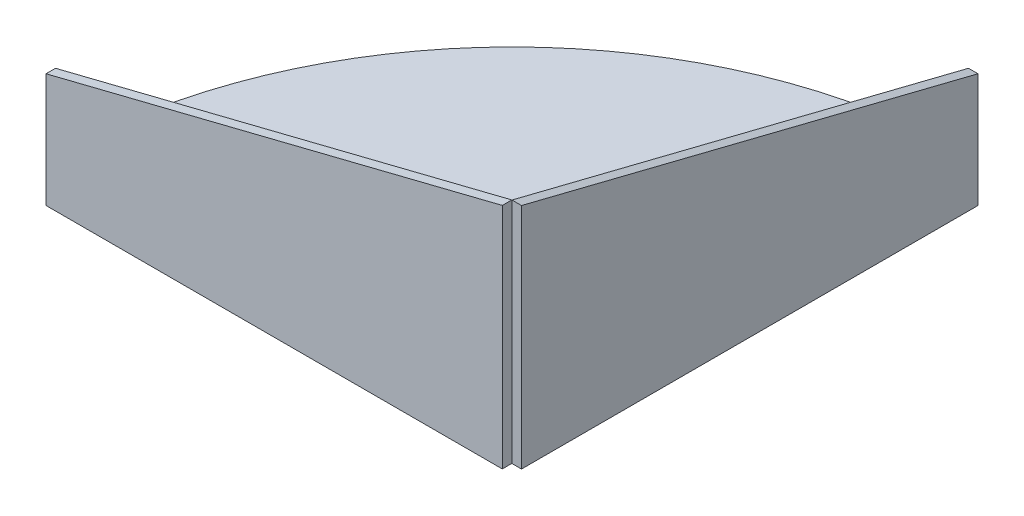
ISO-10303-21;
HEADER;
FILE_DESCRIPTION(('STEP AP214'),'2;1');
FILE_NAME('part.step','',(''),(''),'','','');
FILE_SCHEMA(('AUTOMOTIVE_DESIGN { 1 0 10303 214 1 1 1 1 }'));
ENDSEC;
DATA;
#1=APPLICATION_CONTEXT('core data for automotive mechanical design processes');
#2=APPLICATION_PROTOCOL_DEFINITION('international standard','automotive_design',2000,#1);
#3=PRODUCT_CONTEXT('',#1,'mechanical');
#4=PRODUCT('Part','Part','',(#3));
#5=PRODUCT_RELATED_PRODUCT_CATEGORY('part','',(#4));
#6=PRODUCT_DEFINITION_FORMATION('','',#4);
#7=PRODUCT_DEFINITION_CONTEXT('part definition',#1,'design');
#8=PRODUCT_DEFINITION('design','',#6,#7);
#9=PRODUCT_DEFINITION_SHAPE('','',#8);
#10=(LENGTH_UNIT() NAMED_UNIT(*) SI_UNIT(.MILLI.,.METRE.));
#11=(NAMED_UNIT(*) PLANE_ANGLE_UNIT() SI_UNIT($,.RADIAN.));
#12=(NAMED_UNIT(*) SI_UNIT($,.STERADIAN.) SOLID_ANGLE_UNIT());
#13=UNCERTAINTY_MEASURE_WITH_UNIT(LENGTH_MEASURE(1.E-05),#10,'distance_accuracy_value','');
#14=(GEOMETRIC_REPRESENTATION_CONTEXT(3) GLOBAL_UNCERTAINTY_ASSIGNED_CONTEXT((#13)) GLOBAL_UNIT_ASSIGNED_CONTEXT((#10,
#11,#12)) REPRESENTATION_CONTEXT('',''));
#15=CARTESIAN_POINT('',(0.,0.,0.));
#16=DIRECTION('',(0.,0.,1.));
#17=DIRECTION('',(1.,0.,0.));
#18=AXIS2_PLACEMENT_3D('',#15,#16,#17);
#19=CARTESIAN_POINT('',(-304.8,12.7,304.8));
#20=DIRECTION('',(0.,0.,-1.));
#21=DIRECTION('',(-1.,0.,0.));
#22=AXIS2_PLACEMENT_3D('',#19,#20,#21);
#23=PLANE('',#22);
#24=DIRECTION('',(0.,1.,0.));
#25=VECTOR('',#24,1.);
#26=CARTESIAN_POINT('',(304.546,266.7,304.8));
#27=LINE('',#26,#25);
#28=CARTESIAN_POINT('',(304.546,0.,304.8));
#29=VERTEX_POINT('',#28);
#30=CARTESIAN_POINT('',(304.546,12.7000000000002,304.8));
#31=VERTEX_POINT('',#30);
#32=EDGE_CURVE('E11',#29,#31,#27,.T.);
#33=ORIENTED_EDGE('',*,*,#32,.F.);
#34=DIRECTION('',(1.,0.,0.));
#35=VECTOR('',#34,1.);
#36=CARTESIAN_POINT('',(-304.8,0.,304.8));
#37=LINE('',#36,#35);
#38=CARTESIAN_POINT('',(304.8,0.,304.8));
#39=VERTEX_POINT('',#38);
#40=EDGE_CURVE('E197',#29,#39,#37,.T.);
#41=ORIENTED_EDGE('',*,*,#40,.T.);
#42=DIRECTION('',(0.,-1.,0.));
#43=VECTOR('',#42,1.);
#44=CARTESIAN_POINT('',(304.8,12.7,304.8));
#45=LINE('',#44,#43);
#46=CARTESIAN_POINT('',(304.8,-38.1,304.8));
#47=VERTEX_POINT('',#46);
#48=EDGE_CURVE('E237',#39,#47,#45,.T.);
#49=ORIENTED_EDGE('',*,*,#48,.T.);
#50=DIRECTION('',(-1.,0.,0.));
#51=VECTOR('',#50,1.);
#52=CARTESIAN_POINT('',(317.5,-38.1,304.8));
#53=LINE('',#52,#51);
#54=CARTESIAN_POINT('',(317.5,-38.1,304.8));
#55=VERTEX_POINT('',#54);
#56=EDGE_CURVE('E248',#55,#47,#53,.T.);
#57=ORIENTED_EDGE('',*,*,#56,.F.);
#58=DIRECTION('',(0.,-1.,0.));
#59=VECTOR('',#58,1.);
#60=CARTESIAN_POINT('',(317.5,12.7,304.8));
#61=LINE('',#60,#59);
#62=CARTESIAN_POINT('',(317.5,266.7,304.8));
#63=VERTEX_POINT('',#62);
#64=EDGE_CURVE('E247',#63,#55,#61,.T.);
#65=ORIENTED_EDGE('',*,*,#64,.F.);
#66=DIRECTION('',(-1.,0.,0.));
#67=VECTOR('',#66,1.);
#68=CARTESIAN_POINT('',(317.5,266.7,304.8));
#69=LINE('',#68,#67);
#70=CARTESIAN_POINT('',(304.8,266.7,304.8));
#71=VERTEX_POINT('',#70);
#72=EDGE_CURVE('E240',#63,#71,#69,.T.);
#73=ORIENTED_EDGE('',*,*,#72,.T.);
#74=CARTESIAN_POINT('',(304.8,12.7,304.8));
#75=VERTEX_POINT('',#74);
#76=EDGE_CURVE('E244',#71,#75,#45,.T.);
#77=ORIENTED_EDGE('',*,*,#76,.T.);
#78=DIRECTION('',(1.,0.,0.));
#79=VECTOR('',#78,1.);
#80=CARTESIAN_POINT('',(-304.8,12.7,304.8));
#81=LINE('',#80,#79);
#82=EDGE_CURVE('E213',#31,#75,#81,.T.);
#83=ORIENTED_EDGE('',*,*,#82,.F.);
#84=EDGE_LOOP('',(#33,#41,#49,#57,#65,#73,#77,#83));
#85=FACE_BOUND('',#84,.T.);
#86=ADVANCED_FACE('F31',(#85),#23,.F.);
#87=CARTESIAN_POINT('',(304.8,12.7,304.8));
#88=DIRECTION('',(0.,-1.,0.));
#89=DIRECTION('',(0.,0.,-1.));
#90=AXIS2_PLACEMENT_3D('',#87,#88,#89);
#91=CYLINDRICAL_SURFACE('',#90,609.6);
#92=CARTESIAN_POINT('',(304.8,0.,304.8));
#93=DIRECTION('',(0.,1.,0.));
#94=DIRECTION('',(0.,0.,-1.));
#95=AXIS2_PLACEMENT_3D('',#92,#93,#94);
#96=CIRCLE('',#95,609.6);
#97=CARTESIAN_POINT('',(304.8,0.,-304.8));
#98=VERTEX_POINT('',#97);
#99=CARTESIAN_POINT('',(-304.8,0.,304.8));
#100=VERTEX_POINT('',#99);
#101=EDGE_CURVE('E68',#98,#100,#96,.T.);
#102=ORIENTED_EDGE('',*,*,#101,.T.);
#103=DIRECTION('',(0.,-1.,0.));
#104=VECTOR('',#103,1.);
#105=CARTESIAN_POINT('',(-304.8,12.7,304.8));
#106=LINE('',#105,#104);
#107=CARTESIAN_POINT('',(-304.8,12.7,304.8));
#108=VERTEX_POINT('',#107);
#109=EDGE_CURVE('E215',#108,#100,#106,.T.);
#110=ORIENTED_EDGE('',*,*,#109,.F.);
#111=CARTESIAN_POINT('',(304.8,12.7,304.8));
#112=DIRECTION('',(0.,1.,0.));
#113=DIRECTION('',(0.,0.,-1.));
#114=AXIS2_PLACEMENT_3D('',#111,#112,#113);
#115=CIRCLE('',#114,609.6);
#116=CARTESIAN_POINT('',(304.8,12.7,-304.8));
#117=VERTEX_POINT('',#116);
#118=EDGE_CURVE('E57',#117,#108,#115,.T.);
#119=ORIENTED_EDGE('',*,*,#118,.F.);
#120=DIRECTION('',(0.,-1.,0.));
#121=VECTOR('',#120,1.);
#122=CARTESIAN_POINT('',(304.8,12.7,-304.8));
#123=LINE('',#122,#121);
#124=EDGE_CURVE('E40',#117,#98,#123,.T.);
#125=ORIENTED_EDGE('',*,*,#124,.T.);
#126=EDGE_LOOP('',(#102,#110,#119,#125));
#127=FACE_BOUND('',#126,.T.);
#128=ADVANCED_FACE('F33',(#127),#91,.T.);
#129=CARTESIAN_POINT('',(304.8,12.7,304.8));
#130=DIRECTION('',(0.,-1.,0.));
#131=DIRECTION('',(0.,0.,-1.));
#132=AXIS2_PLACEMENT_3D('',#129,#130,#131);
#133=PLANE('',#132);
#134=DIRECTION('',(0.,0.,-1.));
#135=VECTOR('',#134,1.);
#136=CARTESIAN_POINT('',(304.8,12.7,-304.8));
#137=LINE('',#136,#135);
#138=EDGE_CURVE('E196',#75,#117,#137,.T.);
#139=ORIENTED_EDGE('',*,*,#138,.T.);
#140=ORIENTED_EDGE('',*,*,#118,.T.);
#141=EDGE_CURVE('E214',#108,#31,#81,.T.);
#142=ORIENTED_EDGE('',*,*,#141,.T.);
#143=ORIENTED_EDGE('',*,*,#82,.T.);
#144=EDGE_LOOP('',(#139,#140,#142,#143));
#145=FACE_BOUND('',#144,.T.);
#146=ADVANCED_FACE('F301',(#145),#133,.F.);
#147=CARTESIAN_POINT('',(304.8,0.,304.8));
#148=DIRECTION('',(0.,-1.,0.));
#149=DIRECTION('',(0.,0.,-1.));
#150=AXIS2_PLACEMENT_3D('',#147,#148,#149);
#151=PLANE('',#150);
#152=DIRECTION('',(0.,0.,-1.));
#153=VECTOR('',#152,1.);
#154=CARTESIAN_POINT('',(304.8,0.,-304.8));
#155=LINE('',#154,#153);
#156=EDGE_CURVE('E76',#39,#98,#155,.T.);
#157=ORIENTED_EDGE('',*,*,#156,.F.);
#158=ORIENTED_EDGE('',*,*,#40,.F.);
#159=EDGE_CURVE('E193',#100,#29,#37,.T.);
#160=ORIENTED_EDGE('',*,*,#159,.F.);
#161=ORIENTED_EDGE('',*,*,#101,.F.);
#162=EDGE_LOOP('',(#157,#158,#160,#161));
#163=FACE_BOUND('',#162,.T.);
#164=ADVANCED_FACE('F303',(#163),#151,.T.);
#165=CARTESIAN_POINT('',(304.8,-38.1,304.8));
#166=DIRECTION('',(1.,0.,0.));
#167=DIRECTION('',(0.,0.,-1.));
#168=AXIS2_PLACEMENT_3D('',#165,#166,#167);
#169=PLANE('',#168);
#170=ORIENTED_EDGE('',*,*,#48,.F.);
#171=ORIENTED_EDGE('',*,*,#156,.T.);
#172=DIRECTION('',(0.,1.,0.));
#173=VECTOR('',#172,1.);
#174=CARTESIAN_POINT('',(304.8,114.3,-304.8));
#175=LINE('',#174,#173);
#176=CARTESIAN_POINT('',(304.8,-38.1,-304.8));
#177=VERTEX_POINT('',#176);
#178=EDGE_CURVE('E229',#177,#98,#175,.T.);
#179=ORIENTED_EDGE('',*,*,#178,.F.);
#180=DIRECTION('',(0.,0.,-1.));
#181=VECTOR('',#180,1.);
#182=CARTESIAN_POINT('',(304.8,-38.1,304.8));
#183=LINE('',#182,#181);
#184=EDGE_CURVE('E159',#47,#177,#183,.T.);
#185=ORIENTED_EDGE('',*,*,#184,.F.);
#186=EDGE_LOOP('',(#170,#171,#179,#185));
#187=FACE_BOUND('',#186,.T.);
#188=ADVANCED_FACE('F306',(#187),#169,.F.);
#189=CARTESIAN_POINT('',(317.5,-38.1,304.8));
#190=DIRECTION('',(0.,1.,0.));
#191=DIRECTION('',(0.,0.,1.));
#192=AXIS2_PLACEMENT_3D('',#189,#190,#191);
#193=PLANE('',#192);
#194=ORIENTED_EDGE('',*,*,#184,.T.);
#195=DIRECTION('',(-1.,0.,0.));
#196=VECTOR('',#195,1.);
#197=CARTESIAN_POINT('',(317.5,-38.1,-304.8));
#198=LINE('',#197,#196);
#199=CARTESIAN_POINT('',(317.5,-38.1,-304.8));
#200=VERTEX_POINT('',#199);
#201=EDGE_CURVE('E251',#200,#177,#198,.T.);
#202=ORIENTED_EDGE('',*,*,#201,.F.);
#203=DIRECTION('',(0.,0.,-1.));
#204=VECTOR('',#203,1.);
#205=CARTESIAN_POINT('',(317.5,-38.1,304.8));
#206=LINE('',#205,#204);
#207=EDGE_CURVE('E267',#55,#200,#206,.T.);
#208=ORIENTED_EDGE('',*,*,#207,.F.);
#209=ORIENTED_EDGE('',*,*,#56,.T.);
#210=EDGE_LOOP('',(#194,#202,#208,#209));
#211=FACE_BOUND('',#210,.T.);
#212=ADVANCED_FACE('F275',(#211),#193,.F.);
#213=CARTESIAN_POINT('',(317.5,114.3,-304.8));
#214=DIRECTION('',(0.,0.,1.));
#215=DIRECTION('',(1.,0.,0.));
#216=AXIS2_PLACEMENT_3D('',#213,#214,#215);
#217=PLANE('',#216);
#218=ORIENTED_EDGE('',*,*,#178,.T.);
#219=ORIENTED_EDGE('',*,*,#124,.F.);
#220=CARTESIAN_POINT('',(304.8,114.3,-304.8));
#221=VERTEX_POINT('',#220);
#222=EDGE_CURVE('E162',#117,#221,#175,.T.);
#223=ORIENTED_EDGE('',*,*,#222,.T.);
#224=DIRECTION('',(-1.,0.,0.));
#225=VECTOR('',#224,1.);
#226=CARTESIAN_POINT('',(317.5,114.3,-304.8));
#227=LINE('',#226,#225);
#228=CARTESIAN_POINT('',(317.5,114.3,-304.8));
#229=VERTEX_POINT('',#228);
#230=EDGE_CURVE('E253',#229,#221,#227,.T.);
#231=ORIENTED_EDGE('',*,*,#230,.F.);
#232=DIRECTION('',(0.,1.,0.));
#233=VECTOR('',#232,1.);
#234=CARTESIAN_POINT('',(317.5,-38.1,-304.8));
#235=LINE('',#234,#233);
#236=EDGE_CURVE('E264',#200,#229,#235,.T.);
#237=ORIENTED_EDGE('',*,*,#236,.F.);
#238=ORIENTED_EDGE('',*,*,#201,.T.);
#239=EDGE_LOOP('',(#218,#219,#223,#231,#237,#238));
#240=FACE_BOUND('',#239,.T.);
#241=ADVANCED_FACE('F278',(#240),#217,.F.);
#242=CARTESIAN_POINT('',(317.5,266.7,304.8));
#243=DIRECTION('',(0.,-0.970142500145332,0.242535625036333));
#244=DIRECTION('',(0.,-0.242535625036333,-0.970142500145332));
#245=AXIS2_PLACEMENT_3D('',#242,#243,#244);
#246=PLANE('',#245);
#247=DIRECTION('',(0.,0.242535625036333,0.970142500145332));
#248=VECTOR('',#247,1.);
#249=CARTESIAN_POINT('',(304.8,266.7,304.8));
#250=LINE('',#249,#248);
#251=EDGE_CURVE('E234',#221,#71,#250,.T.);
#252=ORIENTED_EDGE('',*,*,#251,.T.);
#253=ORIENTED_EDGE('',*,*,#72,.F.);
#254=DIRECTION('',(0.,0.242535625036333,0.970142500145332));
#255=VECTOR('',#254,1.);
#256=CARTESIAN_POINT('',(317.5,266.7,304.8));
#257=LINE('',#256,#255);
#258=EDGE_CURVE('E260',#229,#63,#257,.T.);
#259=ORIENTED_EDGE('',*,*,#258,.F.);
#260=ORIENTED_EDGE('',*,*,#230,.T.);
#261=EDGE_LOOP('',(#252,#253,#259,#260));
#262=FACE_BOUND('',#261,.T.);
#263=ADVANCED_FACE('F280',(#262),#246,.F.);
#264=CARTESIAN_POINT('',(317.5,-38.1,304.8));
#265=DIRECTION('',(1.,0.,0.));
#266=DIRECTION('',(0.,0.,-1.));
#267=AXIS2_PLACEMENT_3D('',#264,#265,#266);
#268=PLANE('',#267);
#269=ORIENTED_EDGE('',*,*,#64,.T.);
#270=ORIENTED_EDGE('',*,*,#207,.T.);
#271=ORIENTED_EDGE('',*,*,#236,.T.);
#272=ORIENTED_EDGE('',*,*,#258,.T.);
#273=EDGE_LOOP('',(#269,#270,#271,#272));
#274=FACE_BOUND('',#273,.T.);
#275=ADVANCED_FACE('F271',(#274),#268,.T.);
#276=ORIENTED_EDGE('',*,*,#138,.F.);
#277=ORIENTED_EDGE('',*,*,#76,.F.);
#278=ORIENTED_EDGE('',*,*,#251,.F.);
#279=ORIENTED_EDGE('',*,*,#222,.F.);
#280=EDGE_LOOP('',(#276,#277,#278,#279));
#281=FACE_BOUND('',#280,.T.);
#282=ADVANCED_FACE('F283',(#281),#169,.F.);
#283=CARTESIAN_POINT('',(-304.8,114.3,304.8));
#284=DIRECTION('',(0.,0.,1.));
#285=DIRECTION('',(1.,0.,0.));
#286=AXIS2_PLACEMENT_3D('',#283,#284,#285);
#287=PLANE('',#286);
#288=DIRECTION('',(0.,-1.,0.));
#289=VECTOR('',#288,1.);
#290=CARTESIAN_POINT('',(-304.8,114.3,304.8));
#291=LINE('',#290,#289);
#292=CARTESIAN_POINT('',(-304.8,-38.1,304.8));
#293=VERTEX_POINT('',#292);
#294=EDGE_CURVE('E172',#100,#293,#291,.T.);
#295=ORIENTED_EDGE('',*,*,#294,.F.);
#296=ORIENTED_EDGE('',*,*,#159,.T.);
#297=CARTESIAN_POINT('',(304.546,-38.1,304.8));
#298=VERTEX_POINT('',#297);
#299=EDGE_CURVE('E42',#298,#29,#27,.T.);
#300=ORIENTED_EDGE('',*,*,#299,.F.);
#301=DIRECTION('',(1.,0.,0.));
#302=VECTOR('',#301,1.);
#303=CARTESIAN_POINT('',(-304.8,-38.1,304.8));
#304=LINE('',#303,#302);
#305=EDGE_CURVE('E171',#293,#298,#304,.T.);
#306=ORIENTED_EDGE('',*,*,#305,.F.);
#307=EDGE_LOOP('',(#295,#296,#300,#306));
#308=FACE_BOUND('',#307,.T.);
#309=ADVANCED_FACE('F192',(#308),#287,.F.);
#310=CARTESIAN_POINT('',(304.546,266.7,317.5));
#311=DIRECTION('',(0.242630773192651,-0.970118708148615,0.));
#312=DIRECTION('',(0.970118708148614,0.242630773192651,0.));
#313=AXIS2_PLACEMENT_3D('',#310,#311,#312);
#314=PLANE('',#313);
#315=DIRECTION('',(-0.970118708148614,-0.24263077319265,0.));
#316=VECTOR('',#315,1.);
#317=CARTESIAN_POINT('',(304.546,266.7,304.8));
#318=LINE('',#317,#316);
#319=CARTESIAN_POINT('',(304.546,266.7,304.8));
#320=VERTEX_POINT('',#319);
#321=CARTESIAN_POINT('',(-304.8,114.3,304.8));
#322=VERTEX_POINT('',#321);
#323=EDGE_CURVE('E158',#320,#322,#318,.T.);
#324=ORIENTED_EDGE('',*,*,#323,.T.);
#325=DIRECTION('',(0.,0.,-1.));
#326=VECTOR('',#325,1.);
#327=CARTESIAN_POINT('',(-304.8,114.3,317.5));
#328=LINE('',#327,#326);
#329=CARTESIAN_POINT('',(-304.8,114.3,317.5));
#330=VERTEX_POINT('',#329);
#331=EDGE_CURVE('E139',#330,#322,#328,.T.);
#332=ORIENTED_EDGE('',*,*,#331,.F.);
#333=DIRECTION('',(-0.970118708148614,-0.24263077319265,0.));
#334=VECTOR('',#333,1.);
#335=CARTESIAN_POINT('',(304.546,266.7,317.5));
#336=LINE('',#335,#334);
#337=CARTESIAN_POINT('',(304.546,266.7,317.5));
#338=VERTEX_POINT('',#337);
#339=EDGE_CURVE('E146',#338,#330,#336,.T.);
#340=ORIENTED_EDGE('',*,*,#339,.F.);
#341=DIRECTION('',(0.,0.,-1.));
#342=VECTOR('',#341,1.);
#343=CARTESIAN_POINT('',(304.546,266.7,317.5));
#344=LINE('',#343,#342);
#345=EDGE_CURVE('E181',#338,#320,#344,.T.);
#346=ORIENTED_EDGE('',*,*,#345,.T.);
#347=EDGE_LOOP('',(#324,#332,#340,#346));
#348=FACE_BOUND('',#347,.T.);
#349=ADVANCED_FACE('F156',(#348),#314,.F.);
#350=CARTESIAN_POINT('',(-304.8,114.3,317.5));
#351=DIRECTION('',(1.,0.,0.));
#352=DIRECTION('',(0.,0.,-1.));
#353=AXIS2_PLACEMENT_3D('',#350,#351,#352);
#354=PLANE('',#353);
#355=EDGE_CURVE('E168',#322,#108,#291,.T.);
#356=ORIENTED_EDGE('',*,*,#355,.T.);
#357=ORIENTED_EDGE('',*,*,#109,.T.);
#358=ORIENTED_EDGE('',*,*,#294,.T.);
#359=DIRECTION('',(0.,0.,-1.));
#360=VECTOR('',#359,1.);
#361=CARTESIAN_POINT('',(-304.8,-38.1,317.5));
#362=LINE('',#361,#360);
#363=CARTESIAN_POINT('',(-304.8,-38.1,317.5));
#364=VERTEX_POINT('',#363);
#365=EDGE_CURVE('E142',#364,#293,#362,.T.);
#366=ORIENTED_EDGE('',*,*,#365,.F.);
#367=DIRECTION('',(0.,-1.,0.));
#368=VECTOR('',#367,1.);
#369=CARTESIAN_POINT('',(-304.8,114.3,317.5));
#370=LINE('',#369,#368);
#371=EDGE_CURVE('E134',#330,#364,#370,.T.);
#372=ORIENTED_EDGE('',*,*,#371,.F.);
#373=ORIENTED_EDGE('',*,*,#331,.T.);
#374=EDGE_LOOP('',(#356,#357,#358,#366,#372,#373));
#375=FACE_BOUND('',#374,.T.);
#376=ADVANCED_FACE('F137',(#375),#354,.F.);
#377=CARTESIAN_POINT('',(-304.8,-38.1,317.5));
#378=DIRECTION('',(0.,1.,0.));
#379=DIRECTION('',(0.,0.,1.));
#380=AXIS2_PLACEMENT_3D('',#377,#378,#379);
#381=PLANE('',#380);
#382=ORIENTED_EDGE('',*,*,#305,.T.);
#383=DIRECTION('',(0.,0.,-1.));
#384=VECTOR('',#383,1.);
#385=CARTESIAN_POINT('',(304.546,-38.1,317.5));
#386=LINE('',#385,#384);
#387=CARTESIAN_POINT('',(304.546,-38.1,317.5));
#388=VERTEX_POINT('',#387);
#389=EDGE_CURVE('E164',#388,#298,#386,.T.);
#390=ORIENTED_EDGE('',*,*,#389,.F.);
#391=DIRECTION('',(1.,0.,0.));
#392=VECTOR('',#391,1.);
#393=CARTESIAN_POINT('',(-304.8,-38.1,317.5));
#394=LINE('',#393,#392);
#395=EDGE_CURVE('E145',#364,#388,#394,.T.);
#396=ORIENTED_EDGE('',*,*,#395,.F.);
#397=ORIENTED_EDGE('',*,*,#365,.T.);
#398=EDGE_LOOP('',(#382,#390,#396,#397));
#399=FACE_BOUND('',#398,.T.);
#400=ADVANCED_FACE('F287',(#399),#381,.F.);
#401=CARTESIAN_POINT('',(304.546,266.7,317.5));
#402=DIRECTION('',(-1.,0.,0.));
#403=DIRECTION('',(0.,0.,1.));
#404=AXIS2_PLACEMENT_3D('',#401,#402,#403);
#405=PLANE('',#404);
#406=ORIENTED_EDGE('',*,*,#299,.T.);
#407=ORIENTED_EDGE('',*,*,#32,.T.);
#408=EDGE_CURVE('E43',#31,#320,#27,.T.);
#409=ORIENTED_EDGE('',*,*,#408,.T.);
#410=ORIENTED_EDGE('',*,*,#345,.F.);
#411=DIRECTION('',(0.,1.,0.));
#412=VECTOR('',#411,1.);
#413=CARTESIAN_POINT('',(304.546,266.7,317.5));
#414=LINE('',#413,#412);
#415=EDGE_CURVE('E151',#388,#338,#414,.T.);
#416=ORIENTED_EDGE('',*,*,#415,.F.);
#417=ORIENTED_EDGE('',*,*,#389,.T.);
#418=EDGE_LOOP('',(#406,#407,#409,#410,#416,#417));
#419=FACE_BOUND('',#418,.T.);
#420=ADVANCED_FACE('F186',(#419),#405,.F.);
#421=CARTESIAN_POINT('',(-304.8,114.3,317.5));
#422=DIRECTION('',(0.,0.,1.));
#423=DIRECTION('',(1.,0.,0.));
#424=AXIS2_PLACEMENT_3D('',#421,#422,#423);
#425=PLANE('',#424);
#426=ORIENTED_EDGE('',*,*,#339,.T.);
#427=ORIENTED_EDGE('',*,*,#371,.T.);
#428=ORIENTED_EDGE('',*,*,#395,.T.);
#429=ORIENTED_EDGE('',*,*,#415,.T.);
#430=EDGE_LOOP('',(#426,#427,#428,#429));
#431=FACE_BOUND('',#430,.T.);
#432=ADVANCED_FACE('F149',(#431),#425,.T.);
#433=ORIENTED_EDGE('',*,*,#141,.F.);
#434=ORIENTED_EDGE('',*,*,#355,.F.);
#435=ORIENTED_EDGE('',*,*,#323,.F.);
#436=ORIENTED_EDGE('',*,*,#408,.F.);
#437=EDGE_LOOP('',(#433,#434,#435,#436));
#438=FACE_BOUND('',#437,.T.);
#439=ADVANCED_FACE('F286',(#438),#287,.F.);
#440=CLOSED_SHELL('',(#86,#128,#146,#164,#188,#212,#241,#263,#275,#282,#309,#349,#376,#400,#420,
#432,#439));
#441=MANIFOLD_SOLID_BREP('B2',#440);
#442=ADVANCED_BREP_SHAPE_REPRESENTATION('',(#18,#441),#14);
#443=SHAPE_DEFINITION_REPRESENTATION(#9,#442);
ENDSEC;
END-ISO-10303-21;
